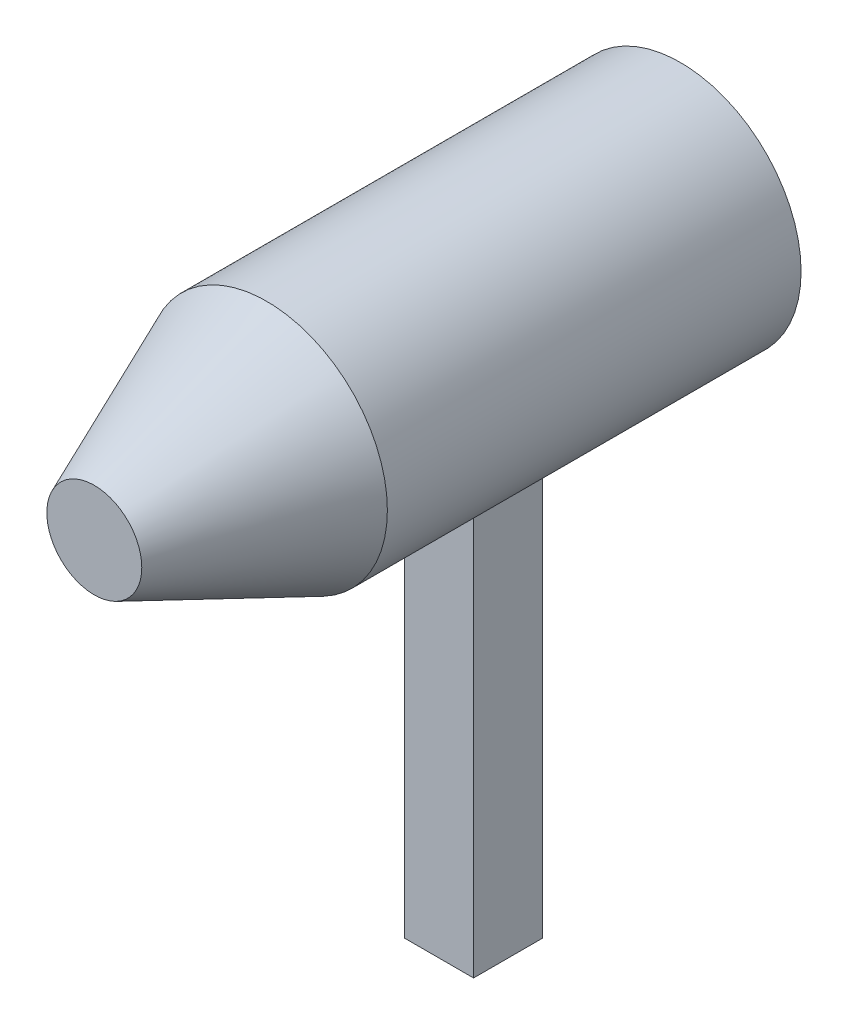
ISO-10303-21;
HEADER;
FILE_DESCRIPTION(('STEP AP214'),'2;1');
FILE_NAME('part.step','',(''),(''),'','','');
FILE_SCHEMA(('AUTOMOTIVE_DESIGN { 1 0 10303 214 1 1 1 1 }'));
ENDSEC;
DATA;
#1=APPLICATION_CONTEXT('core data for automotive mechanical design processes');
#2=APPLICATION_PROTOCOL_DEFINITION('international standard','automotive_design',2000,#1);
#3=PRODUCT_CONTEXT('',#1,'mechanical');
#4=PRODUCT('Part','Part','',(#3));
#5=PRODUCT_RELATED_PRODUCT_CATEGORY('part','',(#4));
#6=PRODUCT_DEFINITION_FORMATION('','',#4);
#7=PRODUCT_DEFINITION_CONTEXT('part definition',#1,'design');
#8=PRODUCT_DEFINITION('design','',#6,#7);
#9=PRODUCT_DEFINITION_SHAPE('','',#8);
#10=(LENGTH_UNIT() NAMED_UNIT(*) SI_UNIT(.MILLI.,.METRE.));
#11=(NAMED_UNIT(*) PLANE_ANGLE_UNIT() SI_UNIT($,.RADIAN.));
#12=(NAMED_UNIT(*) SI_UNIT($,.STERADIAN.) SOLID_ANGLE_UNIT());
#13=UNCERTAINTY_MEASURE_WITH_UNIT(LENGTH_MEASURE(1.E-05),#10,'distance_accuracy_value','');
#14=(GEOMETRIC_REPRESENTATION_CONTEXT(3) GLOBAL_UNCERTAINTY_ASSIGNED_CONTEXT((#13)) GLOBAL_UNIT_ASSIGNED_CONTEXT((#10,
#11,#12)) REPRESENTATION_CONTEXT('',''));
#15=CARTESIAN_POINT('',(0.,0.,0.));
#16=DIRECTION('',(0.,0.,1.));
#17=DIRECTION('',(1.,0.,0.));
#18=AXIS2_PLACEMENT_3D('',#15,#16,#17);
#19=CARTESIAN_POINT('',(-10.,-155.,-50.));
#20=DIRECTION('',(-1.,0.,0.));
#21=DIRECTION('',(0.,0.,1.));
#22=AXIS2_PLACEMENT_3D('',#19,#20,#21);
#23=PLANE('',#22);
#24=DIRECTION('',(0.,0.,1.));
#25=VECTOR('',#24,1.);
#26=CARTESIAN_POINT('',(-10.,-35.,-50.));
#27=LINE('',#26,#25);
#28=CARTESIAN_POINT('',(-10.,-35.,-70.));
#29=VERTEX_POINT('',#28);
#30=CARTESIAN_POINT('',(-10.,-35.,-50.));
#31=VERTEX_POINT('',#30);
#32=EDGE_CURVE('E109',#29,#31,#27,.T.);
#33=ORIENTED_EDGE('',*,*,#32,.F.);
#34=DIRECTION('',(0.,1.,0.));
#35=VECTOR('',#34,1.);
#36=CARTESIAN_POINT('',(-10.,-155.,-70.));
#37=LINE('',#36,#35);
#38=CARTESIAN_POINT('',(-10.,-155.,-70.));
#39=VERTEX_POINT('',#38);
#40=EDGE_CURVE('E12',#39,#29,#37,.T.);
#41=ORIENTED_EDGE('',*,*,#40,.F.);
#42=DIRECTION('',(0.,0.,1.));
#43=VECTOR('',#42,1.);
#44=CARTESIAN_POINT('',(-10.,-155.,-50.));
#45=LINE('',#44,#43);
#46=CARTESIAN_POINT('',(-10.,-155.,-50.));
#47=VERTEX_POINT('',#46);
#48=EDGE_CURVE('E103',#39,#47,#45,.T.);
#49=ORIENTED_EDGE('',*,*,#48,.T.);
#50=DIRECTION('',(0.,1.,0.));
#51=VECTOR('',#50,1.);
#52=CARTESIAN_POINT('',(-10.,-155.,-50.));
#53=LINE('',#52,#51);
#54=EDGE_CURVE('E48',#47,#31,#53,.T.);
#55=ORIENTED_EDGE('',*,*,#54,.T.);
#56=EDGE_LOOP('',(#33,#41,#49,#55));
#57=FACE_BOUND('',#56,.T.);
#58=ADVANCED_FACE('F45',(#57),#23,.T.);
#59=CARTESIAN_POINT('',(9.99999999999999,-155.,-70.));
#60=DIRECTION('',(0.,0.,-1.));
#61=DIRECTION('',(-1.,0.,0.));
#62=AXIS2_PLACEMENT_3D('',#59,#60,#61);
#63=PLANE('',#62);
#64=DIRECTION('',(-1.,0.,0.));
#65=VECTOR('',#64,1.);
#66=CARTESIAN_POINT('',(9.99999999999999,-35.,-70.));
#67=LINE('',#66,#65);
#68=CARTESIAN_POINT('',(9.99999999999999,-35.,-70.));
#69=VERTEX_POINT('',#68);
#70=EDGE_CURVE('E105',#69,#29,#67,.T.);
#71=ORIENTED_EDGE('',*,*,#70,.F.);
#72=DIRECTION('',(0.,1.,0.));
#73=VECTOR('',#72,1.);
#74=CARTESIAN_POINT('',(9.99999999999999,-155.,-70.));
#75=LINE('',#74,#73);
#76=CARTESIAN_POINT('',(9.99999999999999,-155.,-70.));
#77=VERTEX_POINT('',#76);
#78=EDGE_CURVE('E54',#77,#69,#75,.T.);
#79=ORIENTED_EDGE('',*,*,#78,.F.);
#80=DIRECTION('',(-1.,0.,0.));
#81=VECTOR('',#80,1.);
#82=CARTESIAN_POINT('',(9.99999999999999,-155.,-70.));
#83=LINE('',#82,#81);
#84=EDGE_CURVE('E100',#77,#39,#83,.T.);
#85=ORIENTED_EDGE('',*,*,#84,.T.);
#86=ORIENTED_EDGE('',*,*,#40,.T.);
#87=EDGE_LOOP('',(#71,#79,#85,#86));
#88=FACE_BOUND('',#87,.T.);
#89=ADVANCED_FACE('F119',(#88),#63,.T.);
#90=CARTESIAN_POINT('',(9.99999999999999,-155.,-50.));
#91=DIRECTION('',(1.,0.,0.));
#92=DIRECTION('',(0.,0.,-1.));
#93=AXIS2_PLACEMENT_3D('',#90,#91,#92);
#94=PLANE('',#93);
#95=DIRECTION('',(0.,0.,-1.));
#96=VECTOR('',#95,1.);
#97=CARTESIAN_POINT('',(9.99999999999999,-35.,-50.));
#98=LINE('',#97,#96);
#99=CARTESIAN_POINT('',(9.99999999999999,-35.,-50.));
#100=VERTEX_POINT('',#99);
#101=EDGE_CURVE('E95',#100,#69,#98,.T.);
#102=ORIENTED_EDGE('',*,*,#101,.F.);
#103=DIRECTION('',(0.,1.,0.));
#104=VECTOR('',#103,1.);
#105=CARTESIAN_POINT('',(9.99999999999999,-155.,-50.));
#106=LINE('',#105,#104);
#107=CARTESIAN_POINT('',(9.99999999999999,-155.,-50.));
#108=VERTEX_POINT('',#107);
#109=EDGE_CURVE('E90',#108,#100,#106,.T.);
#110=ORIENTED_EDGE('',*,*,#109,.F.);
#111=DIRECTION('',(0.,0.,-1.));
#112=VECTOR('',#111,1.);
#113=CARTESIAN_POINT('',(9.99999999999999,-155.,-50.));
#114=LINE('',#113,#112);
#115=EDGE_CURVE('E93',#108,#77,#114,.T.);
#116=ORIENTED_EDGE('',*,*,#115,.T.);
#117=ORIENTED_EDGE('',*,*,#78,.T.);
#118=EDGE_LOOP('',(#102,#110,#116,#117));
#119=FACE_BOUND('',#118,.T.);
#120=ADVANCED_FACE('F92',(#119),#94,.T.);
#121=CARTESIAN_POINT('',(9.99999999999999,-155.,-50.));
#122=DIRECTION('',(0.,0.,1.));
#123=DIRECTION('',(1.,0.,0.));
#124=AXIS2_PLACEMENT_3D('',#121,#122,#123);
#125=PLANE('',#124);
#126=DIRECTION('',(1.,0.,0.));
#127=VECTOR('',#126,1.);
#128=CARTESIAN_POINT('',(9.99999999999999,-35.,-50.));
#129=LINE('',#128,#127);
#130=EDGE_CURVE('E112',#31,#100,#129,.T.);
#131=ORIENTED_EDGE('',*,*,#130,.F.);
#132=ORIENTED_EDGE('',*,*,#54,.F.);
#133=DIRECTION('',(1.,0.,0.));
#134=VECTOR('',#133,1.);
#135=CARTESIAN_POINT('',(9.99999999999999,-155.,-50.));
#136=LINE('',#135,#134);
#137=EDGE_CURVE('E99',#47,#108,#136,.T.);
#138=ORIENTED_EDGE('',*,*,#137,.T.);
#139=ORIENTED_EDGE('',*,*,#109,.T.);
#140=EDGE_LOOP('',(#131,#132,#138,#139));
#141=FACE_BOUND('',#140,.T.);
#142=ADVANCED_FACE('F102',(#141),#125,.T.);
#143=CARTESIAN_POINT('',(0.,-155.,0.));
#144=DIRECTION('',(0.,1.,0.));
#145=DIRECTION('',(0.,0.,1.));
#146=AXIS2_PLACEMENT_3D('',#143,#144,#145);
#147=PLANE('',#146);
#148=ORIENTED_EDGE('',*,*,#48,.F.);
#149=ORIENTED_EDGE('',*,*,#84,.F.);
#150=ORIENTED_EDGE('',*,*,#115,.F.);
#151=ORIENTED_EDGE('',*,*,#137,.F.);
#152=EDGE_LOOP('',(#148,#149,#150,#151));
#153=FACE_BOUND('',#152,.T.);
#154=ADVANCED_FACE('F98',(#153),#147,.F.);
#155=CARTESIAN_POINT('',(0.,-35.,0.));
#156=DIRECTION('',(0.,1.,0.));
#157=DIRECTION('',(0.,0.,1.));
#158=AXIS2_PLACEMENT_3D('',#155,#156,#157);
#159=PLANE('',#158);
#160=ORIENTED_EDGE('',*,*,#32,.T.);
#161=ORIENTED_EDGE('',*,*,#130,.T.);
#162=ORIENTED_EDGE('',*,*,#101,.T.);
#163=ORIENTED_EDGE('',*,*,#70,.T.);
#164=EDGE_LOOP('',(#160,#161,#162,#163));
#165=FACE_BOUND('',#164,.T.);
#166=ADVANCED_FACE('F118',(#165),#159,.T.);
#167=CLOSED_SHELL('',(#58,#89,#120,#142,#154,#166));
#168=MANIFOLD_SOLID_BREP('B2',#167);
#169=CARTESIAN_POINT('',(0.,0.,0.));
#170=DIRECTION('',(0.,0.,-1.));
#171=DIRECTION('',(1.,0.,0.));
#172=AXIS2_PLACEMENT_3D('',#169,#170,#171);
#173=CONICAL_SURFACE('',#172,35.,0.401425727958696);
#174=CARTESIAN_POINT('',(0.,0.,50.01));
#175=DIRECTION('',(0.,0.,1.));
#176=DIRECTION('',(1.,0.,0.));
#177=AXIS2_PLACEMENT_3D('',#174,#175,#176);
#178=CIRCLE('',#177,13.7720144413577);
#179=CARTESIAN_POINT('',(13.7720144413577,0.,50.01));
#180=VERTEX_POINT('',#179);
#181=EDGE_CURVE('E44',#180,#180,#178,.T.);
#182=ORIENTED_EDGE('',*,*,#181,.F.);
#183=EDGE_LOOP('',(#182));
#184=FACE_BOUND('',#183,.T.);
#185=CARTESIAN_POINT('',(0.,0.,0.));
#186=DIRECTION('',(0.,0.,-1.));
#187=DIRECTION('',(-1.,0.,0.));
#188=AXIS2_PLACEMENT_3D('',#185,#186,#187);
#189=CIRCLE('',#188,35.);
#190=CARTESIAN_POINT('',(-35.,0.,0.));
#191=VERTEX_POINT('',#190);
#192=EDGE_CURVE('E179',#191,#191,#189,.T.);
#193=ORIENTED_EDGE('',*,*,#192,.F.);
#194=EDGE_LOOP('',(#193));
#195=FACE_BOUND('',#194,.T.);
#196=ADVANCED_FACE('F169',(#184,#195),#173,.T.);
#197=CARTESIAN_POINT('',(0.,0.,50.01));
#198=DIRECTION('',(0.,0.,1.));
#199=DIRECTION('',(1.,0.,0.));
#200=AXIS2_PLACEMENT_3D('',#197,#198,#199);
#201=PLANE('',#200);
#202=ORIENTED_EDGE('',*,*,#181,.T.);
#203=EDGE_LOOP('',(#202));
#204=FACE_BOUND('',#203,.T.);
#205=ADVANCED_FACE('F189',(#204),#201,.T.);
#206=CARTESIAN_POINT('',(0.,0.,-120.));
#207=DIRECTION('',(0.,0.,1.));
#208=DIRECTION('',(1.,0.,0.));
#209=AXIS2_PLACEMENT_3D('',#206,#207,#208);
#210=CYLINDRICAL_SURFACE('',#209,35.);
#211=CARTESIAN_POINT('',(0.,0.,-120.));
#212=DIRECTION('',(0.,0.,-1.));
#213=DIRECTION('',(-1.,0.,0.));
#214=AXIS2_PLACEMENT_3D('',#211,#212,#213);
#215=CIRCLE('',#214,35.);
#216=CARTESIAN_POINT('',(-35.,0.,-120.));
#217=VERTEX_POINT('',#216);
#218=EDGE_CURVE('E175',#217,#217,#215,.T.);
#219=ORIENTED_EDGE('',*,*,#218,.F.);
#220=EDGE_LOOP('',(#219));
#221=FACE_BOUND('',#220,.T.);
#222=ORIENTED_EDGE('',*,*,#192,.T.);
#223=EDGE_LOOP('',(#222));
#224=FACE_BOUND('',#223,.T.);
#225=ADVANCED_FACE('F186',(#221,#224),#210,.T.);
#226=CARTESIAN_POINT('',(0.,0.,-120.));
#227=DIRECTION('',(0.,0.,-1.));
#228=DIRECTION('',(-1.,0.,0.));
#229=AXIS2_PLACEMENT_3D('',#226,#227,#228);
#230=PLANE('',#229);
#231=ORIENTED_EDGE('',*,*,#218,.T.);
#232=EDGE_LOOP('',(#231));
#233=FACE_BOUND('',#232,.T.);
#234=ADVANCED_FACE('F197',(#233),#230,.T.);
#235=CLOSED_SHELL('',(#196,#205,#225,#234));
#236=MANIFOLD_SOLID_BREP('B6',#235);
#237=ADVANCED_BREP_SHAPE_REPRESENTATION('',(#18,#168,#236),#14);
#238=SHAPE_DEFINITION_REPRESENTATION(#9,#237);
ENDSEC;
END-ISO-10303-21;
